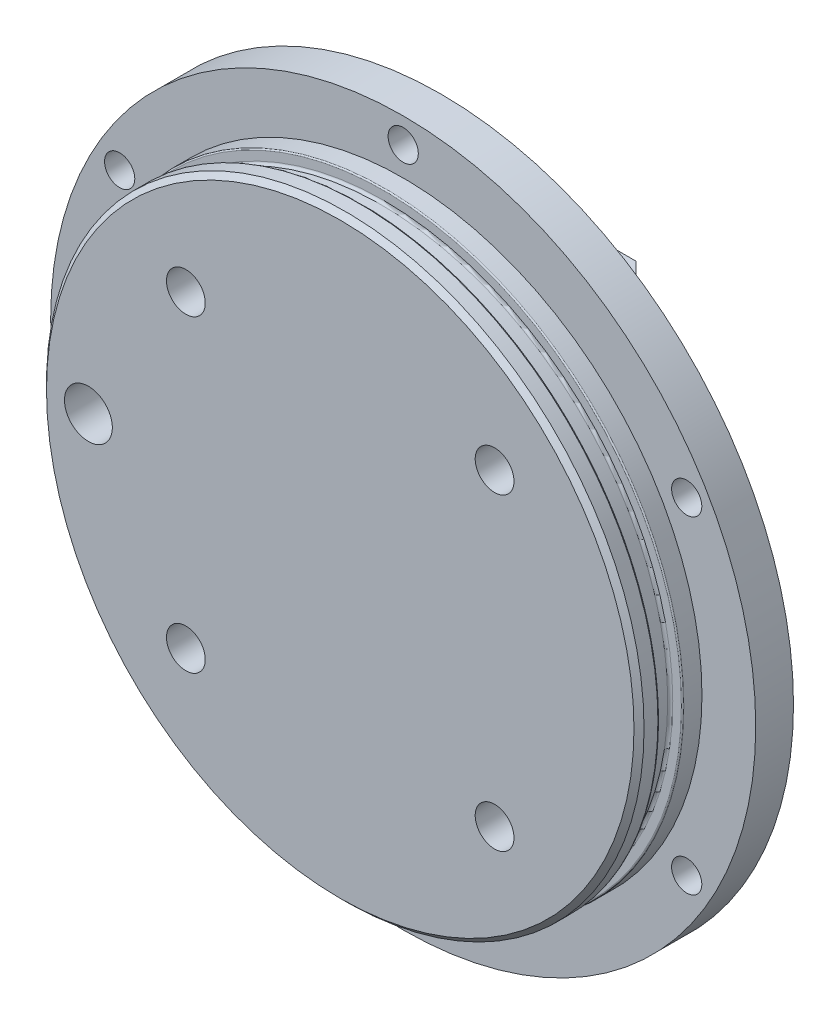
ISO-10303-21;
HEADER;
FILE_DESCRIPTION(('STEP AP214'),'2;1');
FILE_NAME('part.step','',(''),(''),'','','');
FILE_SCHEMA(('AUTOMOTIVE_DESIGN { 1 0 10303 214 1 1 1 1 }'));
ENDSEC;
DATA;
#1=APPLICATION_CONTEXT('core data for automotive mechanical design processes');
#2=APPLICATION_PROTOCOL_DEFINITION('international standard','automotive_design',2000,#1);
#3=PRODUCT_CONTEXT('',#1,'mechanical');
#4=PRODUCT('Part','Part','',(#3));
#5=PRODUCT_RELATED_PRODUCT_CATEGORY('part','',(#4));
#6=PRODUCT_DEFINITION_FORMATION('','',#4);
#7=PRODUCT_DEFINITION_CONTEXT('part definition',#1,'design');
#8=PRODUCT_DEFINITION('design','',#6,#7);
#9=PRODUCT_DEFINITION_SHAPE('','',#8);
#10=(LENGTH_UNIT() NAMED_UNIT(*) SI_UNIT(.MILLI.,.METRE.));
#11=(NAMED_UNIT(*) PLANE_ANGLE_UNIT() SI_UNIT($,.RADIAN.));
#12=(NAMED_UNIT(*) SI_UNIT($,.STERADIAN.) SOLID_ANGLE_UNIT());
#13=UNCERTAINTY_MEASURE_WITH_UNIT(LENGTH_MEASURE(1.E-05),#10,'distance_accuracy_value','');
#14=(GEOMETRIC_REPRESENTATION_CONTEXT(3) GLOBAL_UNCERTAINTY_ASSIGNED_CONTEXT((#13)) GLOBAL_UNIT_ASSIGNED_CONTEXT((#10,
#11,#12)) REPRESENTATION_CONTEXT('',''));
#15=CARTESIAN_POINT('',(0.,0.,0.));
#16=DIRECTION('',(0.,0.,1.));
#17=DIRECTION('',(1.,0.,0.));
#18=AXIS2_PLACEMENT_3D('',#15,#16,#17);
#19=CARTESIAN_POINT('',(0.,0.,10.1600000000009));
#20=DIRECTION('',(0.,0.,1.));
#21=DIRECTION('',(0.999999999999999,0.,0.));
#22=AXIS2_PLACEMENT_3D('',#19,#20,#21);
#23=PLANE('',#22);
#24=CARTESIAN_POINT('',(0.,0.,10.1600000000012));
#25=DIRECTION('',(0.,0.,1.));
#26=DIRECTION('',(0.999999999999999,0.,0.));
#27=AXIS2_PLACEMENT_3D('',#24,#25,#26);
#28=CIRCLE('',#27,29.6291);
#29=CARTESIAN_POINT('',(29.6291,0.,10.1600000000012));
#30=VERTEX_POINT('',#29);
#31=EDGE_CURVE('E40',#30,#30,#28,.T.);
#32=ORIENTED_EDGE('',*,*,#31,.T.);
#33=EDGE_LOOP('',(#32));
#34=FACE_BOUND('',#33,.T.);
#35=CARTESIAN_POINT('',(15.5702000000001,15.5702,10.1600000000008));
#36=DIRECTION('',(0.,0.,1.));
#37=DIRECTION('',(0.999999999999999,0.,0.));
#38=AXIS2_PLACEMENT_3D('',#35,#36,#37);
#39=CIRCLE('',#38,1.9558);
#40=CARTESIAN_POINT('',(17.5260000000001,15.5702,10.1600000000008));
#41=VERTEX_POINT('',#40);
#42=EDGE_CURVE('E207',#41,#41,#39,.T.);
#43=ORIENTED_EDGE('',*,*,#42,.F.);
#44=EDGE_LOOP('',(#43));
#45=FACE_BOUND('',#44,.T.);
#46=CARTESIAN_POINT('',(-15.5701999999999,15.5702,10.1600000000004));
#47=DIRECTION('',(0.,0.,1.));
#48=DIRECTION('',(0.999999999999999,0.,0.));
#49=AXIS2_PLACEMENT_3D('',#46,#47,#48);
#50=CIRCLE('',#49,1.9558);
#51=CARTESIAN_POINT('',(-13.6143999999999,15.5702,10.1600000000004));
#52=VERTEX_POINT('',#51);
#53=EDGE_CURVE('E201',#52,#52,#50,.T.);
#54=ORIENTED_EDGE('',*,*,#53,.F.);
#55=EDGE_LOOP('',(#54));
#56=FACE_BOUND('',#55,.T.);
#57=CARTESIAN_POINT('',(-15.5701999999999,-15.5702000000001,10.1600000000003));
#58=DIRECTION('',(0.,0.,1.));
#59=DIRECTION('',(0.999999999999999,0.,0.));
#60=AXIS2_PLACEMENT_3D('',#57,#58,#59);
#61=CIRCLE('',#60,1.9558);
#62=CARTESIAN_POINT('',(-13.6143999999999,-15.5702000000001,10.1600000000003));
#63=VERTEX_POINT('',#62);
#64=EDGE_CURVE('E195',#63,#63,#61,.T.);
#65=ORIENTED_EDGE('',*,*,#64,.F.);
#66=EDGE_LOOP('',(#65));
#67=FACE_BOUND('',#66,.T.);
#68=CARTESIAN_POINT('',(15.5702000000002,-15.5701999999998,10.1600000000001));
#69=DIRECTION('',(0.,0.,1.));
#70=DIRECTION('',(0.999999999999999,0.,0.));
#71=AXIS2_PLACEMENT_3D('',#68,#69,#70);
#72=CIRCLE('',#71,1.9558);
#73=CARTESIAN_POINT('',(17.5260000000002,-15.5701999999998,10.1600000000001));
#74=VERTEX_POINT('',#73);
#75=EDGE_CURVE('E178',#74,#74,#72,.T.);
#76=ORIENTED_EDGE('',*,*,#75,.F.);
#77=EDGE_LOOP('',(#76));
#78=FACE_BOUND('',#77,.T.);
#79=CARTESIAN_POINT('',(-25.3999999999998,0.,10.1600000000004));
#80=DIRECTION('',(0.,0.,-1.));
#81=DIRECTION('',(-0.999999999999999,0.,0.));
#82=AXIS2_PLACEMENT_3D('',#79,#80,#81);
#83=CIRCLE('',#82,2.41300000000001);
#84=CARTESIAN_POINT('',(-27.8129999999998,0.,10.1600000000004));
#85=VERTEX_POINT('',#84);
#86=EDGE_CURVE('E470',#85,#85,#83,.T.);
#87=ORIENTED_EDGE('',*,*,#86,.T.);
#88=EDGE_LOOP('',(#87));
#89=FACE_BOUND('',#88,.T.);
#90=ADVANCED_FACE('F32',(#34,#45,#56,#67,#78,#89),#23,.T.);
#91=CARTESIAN_POINT('',(0.,0.,-16.5100000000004));
#92=DIRECTION('',(0.,0.,1.));
#93=DIRECTION('',(0.999999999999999,0.,0.));
#94=AXIS2_PLACEMENT_3D('',#91,#92,#93);
#95=CYLINDRICAL_SURFACE('',#94,15.875);
#96=CARTESIAN_POINT('',(0.,0.,0.));
#97=DIRECTION('',(0.,0.,-1.));
#98=DIRECTION('',(-0.999999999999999,0.,0.));
#99=AXIS2_PLACEMENT_3D('',#96,#97,#98);
#100=CIRCLE('',#99,15.875);
#101=CARTESIAN_POINT('',(-15.8749999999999,0.,0.));
#102=VERTEX_POINT('',#101);
#103=EDGE_CURVE('E185',#102,#102,#100,.T.);
#104=ORIENTED_EDGE('',*,*,#103,.T.);
#105=EDGE_LOOP('',(#104));
#106=FACE_BOUND('',#105,.T.);
#107=CARTESIAN_POINT('',(1.11022302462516E-13,0.,-19.6850000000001));
#108=DIRECTION('',(-0.707106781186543,0.,-0.707106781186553));
#109=DIRECTION('',(-0.70710678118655,0.,0.707106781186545));
#110=AXIS2_PLACEMENT_3D('',#107,#108,#109);
#111=ELLIPSE('',#110,22.4506403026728,15.875);
#112=CARTESIAN_POINT('',(-15.1437848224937,4.7625,-4.54121517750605));
#113=VERTEX_POINT('',#112);
#114=CARTESIAN_POINT('',(-6.91975207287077,14.2874999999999,-12.7652479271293));
#115=VERTEX_POINT('',#114);
#116=EDGE_CURVE('E482',#113,#115,#111,.T.);
#117=ORIENTED_EDGE('',*,*,#116,.F.);
#118=DIRECTION('',(0.,0.,-1.));
#119=VECTOR('',#118,1.);
#120=CARTESIAN_POINT('',(-15.143784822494,4.76249999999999,-0.253999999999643));
#121=LINE('',#120,#119);
#122=CARTESIAN_POINT('',(-15.143784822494,4.76249999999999,-0.253999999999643));
#123=VERTEX_POINT('',#122);
#124=EDGE_CURVE('E182',#123,#113,#121,.T.);
#125=ORIENTED_EDGE('',*,*,#124,.F.);
#126=CARTESIAN_POINT('',(0.,0.,-0.253999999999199));
#127=DIRECTION('',(0.,0.,-1.));
#128=DIRECTION('',(-0.999999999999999,0.,0.));
#129=AXIS2_PLACEMENT_3D('',#126,#127,#128);
#130=CIRCLE('',#129,15.875);
#131=CARTESIAN_POINT('',(-15.1437848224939,-4.76250000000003,-0.25399999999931));
#132=VERTEX_POINT('',#131);
#133=EDGE_CURVE('E523',#132,#123,#130,.T.);
#134=ORIENTED_EDGE('',*,*,#133,.F.);
#135=DIRECTION('',(0.,0.,-1.));
#136=VECTOR('',#135,1.);
#137=CARTESIAN_POINT('',(-15.1437848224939,-4.76250000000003,-0.25399999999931));
#138=LINE('',#137,#136);
#139=CARTESIAN_POINT('',(-15.1437848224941,-4.7625,-4.54121517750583));
#140=VERTEX_POINT('',#139);
#141=EDGE_CURVE('E163',#132,#140,#138,.T.);
#142=ORIENTED_EDGE('',*,*,#141,.T.);
#143=CARTESIAN_POINT('',(-6.91975207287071,-14.2875,-12.7652479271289));
#144=VERTEX_POINT('',#143);
#145=EDGE_CURVE('E47',#144,#140,#111,.T.);
#146=ORIENTED_EDGE('',*,*,#145,.F.);
#147=DIRECTION('',(0.,0.,-1.));
#148=VECTOR('',#147,1.);
#149=CARTESIAN_POINT('',(-6.91975207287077,-14.2875,-0.253999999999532));
#150=LINE('',#149,#148);
#151=CARTESIAN_POINT('',(-6.91975207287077,-14.2875,-0.253999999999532));
#152=VERTEX_POINT('',#151);
#153=EDGE_CURVE('E510',#152,#144,#150,.T.);
#154=ORIENTED_EDGE('',*,*,#153,.F.);
#155=CARTESIAN_POINT('',(6.91975207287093,-14.2875,-0.253999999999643));
#156=VERTEX_POINT('',#155);
#157=EDGE_CURVE('E188',#156,#152,#130,.T.);
#158=ORIENTED_EDGE('',*,*,#157,.F.);
#159=DIRECTION('',(0.,0.,-1.));
#160=VECTOR('',#159,1.);
#161=CARTESIAN_POINT('',(6.91975207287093,-14.2875,-0.253999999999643));
#162=LINE('',#161,#160);
#163=CARTESIAN_POINT('',(6.91975207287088,-14.2875,-12.7652479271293));
#164=VERTEX_POINT('',#163);
#165=EDGE_CURVE('E166',#156,#164,#162,.T.);
#166=ORIENTED_EDGE('',*,*,#165,.T.);
#167=CARTESIAN_POINT('',(1.11022302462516E-13,0.,-19.6850000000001));
#168=DIRECTION('',(0.707106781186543,0.,-0.707106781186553));
#169=DIRECTION('',(0.70710678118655,0.,0.707106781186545));
#170=AXIS2_PLACEMENT_3D('',#167,#168,#169);
#171=ELLIPSE('',#170,22.4506403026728,15.875);
#172=CARTESIAN_POINT('',(15.1437848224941,-4.76250000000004,-4.54121517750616));
#173=VERTEX_POINT('',#172);
#174=EDGE_CURVE('E476',#173,#164,#171,.T.);
#175=ORIENTED_EDGE('',*,*,#174,.F.);
#176=DIRECTION('',(0.,0.,-1.));
#177=VECTOR('',#176,1.);
#178=CARTESIAN_POINT('',(15.143784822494,-4.76250000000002,-0.25400000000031));
#179=LINE('',#178,#177);
#180=CARTESIAN_POINT('',(15.143784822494,-4.76250000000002,-0.25400000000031));
#181=VERTEX_POINT('',#180);
#182=EDGE_CURVE('E158',#181,#173,#179,.T.);
#183=ORIENTED_EDGE('',*,*,#182,.F.);
#184=CARTESIAN_POINT('',(15.143784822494,4.7625,-0.253999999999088));
#185=VERTEX_POINT('',#184);
#186=EDGE_CURVE('E284',#185,#181,#130,.T.);
#187=ORIENTED_EDGE('',*,*,#186,.F.);
#188=DIRECTION('',(0.,0.,-1.));
#189=VECTOR('',#188,1.);
#190=CARTESIAN_POINT('',(15.143784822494,4.7625,-0.253999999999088));
#191=LINE('',#190,#189);
#192=CARTESIAN_POINT('',(15.1437848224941,4.76249999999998,-4.54121517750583));
#193=VERTEX_POINT('',#192);
#194=EDGE_CURVE('E174',#185,#193,#191,.T.);
#195=ORIENTED_EDGE('',*,*,#194,.T.);
#196=CARTESIAN_POINT('',(6.91975207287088,14.2875,-12.765247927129));
#197=VERTEX_POINT('',#196);
#198=EDGE_CURVE('E138',#197,#193,#171,.T.);
#199=ORIENTED_EDGE('',*,*,#198,.F.);
#200=DIRECTION('',(0.,0.,-1.));
#201=VECTOR('',#200,1.);
#202=CARTESIAN_POINT('',(6.91975207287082,14.2875,-0.253999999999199));
#203=LINE('',#202,#201);
#204=CARTESIAN_POINT('',(6.91975207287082,14.2875,-0.253999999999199));
#205=VERTEX_POINT('',#204);
#206=EDGE_CURVE('E175',#205,#197,#203,.T.);
#207=ORIENTED_EDGE('',*,*,#206,.F.);
#208=CARTESIAN_POINT('',(-6.91975207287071,14.2875,-0.253999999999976));
#209=VERTEX_POINT('',#208);
#210=EDGE_CURVE('E281',#209,#205,#130,.T.);
#211=ORIENTED_EDGE('',*,*,#210,.F.);
#212=DIRECTION('',(0.,0.,-1.));
#213=VECTOR('',#212,1.);
#214=CARTESIAN_POINT('',(-6.91975207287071,14.2875,-0.253999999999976));
#215=LINE('',#214,#213);
#216=EDGE_CURVE('E179',#209,#115,#215,.T.);
#217=ORIENTED_EDGE('',*,*,#216,.T.);
#218=EDGE_LOOP('',(#117,#125,#134,#142,#146,#154,#158,#166,#175,#183,#187,#195,#199,#207,#211,#217));
#219=FACE_BOUND('',#218,.T.);
#220=ADVANCED_FACE('F311',(#106,#219),#95,.T.);
#221=CARTESIAN_POINT('',(0.,0.,-16.5100000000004));
#222=DIRECTION('',(0.,0.,-1.));
#223=DIRECTION('',(-0.999999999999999,0.,0.));
#224=AXIS2_PLACEMENT_3D('',#221,#222,#223);
#225=PLANE('',#224);
#226=DIRECTION('',(0.,-1.,0.));
#227=VECTOR('',#226,1.);
#228=CARTESIAN_POINT('',(-3.17500000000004,144.355977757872,-16.5099999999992));
#229=LINE('',#228,#227);
#230=CARTESIAN_POINT('',(-3.17499999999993,14.2875,-16.5099999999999));
#231=VERTEX_POINT('',#230);
#232=CARTESIAN_POINT('',(-3.17499999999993,4.76249999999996,-16.5099999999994));
#233=VERTEX_POINT('',#232);
#234=EDGE_CURVE('E475',#231,#233,#229,.T.);
#235=ORIENTED_EDGE('',*,*,#234,.F.);
#236=DIRECTION('',(0.999999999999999,0.,0.));
#237=VECTOR('',#236,1.);
#238=CARTESIAN_POINT('',(6.91975207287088,14.2875,-16.5099999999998));
#239=LINE('',#238,#237);
#240=CARTESIAN_POINT('',(3.17500000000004,14.2875,-16.5099999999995));
#241=VERTEX_POINT('',#240);
#242=EDGE_CURVE('E151',#231,#241,#239,.T.);
#243=ORIENTED_EDGE('',*,*,#242,.T.);
#244=DIRECTION('',(0.,-1.,0.));
#245=VECTOR('',#244,1.);
#246=CARTESIAN_POINT('',(3.17500000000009,144.355977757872,-16.5099999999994));
#247=LINE('',#246,#245);
#248=CARTESIAN_POINT('',(3.17500000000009,4.76249999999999,-16.5099999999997));
#249=VERTEX_POINT('',#248);
#250=EDGE_CURVE('E135',#241,#249,#247,.T.);
#251=ORIENTED_EDGE('',*,*,#250,.T.);
#252=DIRECTION('',(-0.999999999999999,0.,0.));
#253=VECTOR('',#252,1.);
#254=CARTESIAN_POINT('',(15.1437848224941,4.76249999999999,-16.5099999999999));
#255=LINE('',#254,#253);
#256=EDGE_CURVE('E149',#249,#233,#255,.T.);
#257=ORIENTED_EDGE('',*,*,#256,.T.);
#258=EDGE_LOOP('',(#235,#243,#251,#257));
#259=FACE_BOUND('',#258,.T.);
#260=ADVANCED_FACE('F148',(#259),#225,.T.);
#261=CARTESIAN_POINT('',(-3.17499999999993,-4.7625,-16.5099999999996));
#262=VERTEX_POINT('',#261);
#263=CARTESIAN_POINT('',(-3.17499999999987,-14.2875,-16.5100000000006));
#264=VERTEX_POINT('',#263);
#265=EDGE_CURVE('E152',#262,#264,#229,.T.);
#266=ORIENTED_EDGE('',*,*,#265,.F.);
#267=DIRECTION('',(0.999999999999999,0.,0.));
#268=VECTOR('',#267,1.);
#269=CARTESIAN_POINT('',(15.143784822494,-4.76250000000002,-16.5099999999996));
#270=LINE('',#269,#268);
#271=CARTESIAN_POINT('',(3.17499999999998,-4.76249999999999,-16.5100000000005));
#272=VERTEX_POINT('',#271);
#273=EDGE_CURVE('E500',#262,#272,#270,.T.);
#274=ORIENTED_EDGE('',*,*,#273,.T.);
#275=CARTESIAN_POINT('',(3.17500000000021,-14.2875,-16.5099999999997));
#276=VERTEX_POINT('',#275);
#277=EDGE_CURVE('E55',#272,#276,#247,.T.);
#278=ORIENTED_EDGE('',*,*,#277,.T.);
#279=DIRECTION('',(-0.999999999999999,0.,0.));
#280=VECTOR('',#279,1.);
#281=CARTESIAN_POINT('',(-6.9197520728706,-14.2875,-16.5099999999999));
#282=LINE('',#281,#280);
#283=EDGE_CURVE('E497',#276,#264,#282,.T.);
#284=ORIENTED_EDGE('',*,*,#283,.T.);
#285=EDGE_LOOP('',(#266,#274,#278,#284));
#286=FACE_BOUND('',#285,.T.);
#287=ADVANCED_FACE('F419',(#286),#225,.T.);
#288=CARTESIAN_POINT('',(-6.91975207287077,-14.2875,-0.253999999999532));
#289=DIRECTION('',(0.,-1.,0.));
#290=DIRECTION('',(0.,0.,-1.));
#291=AXIS2_PLACEMENT_3D('',#288,#289,#290);
#292=PLANE('',#291);
#293=CARTESIAN_POINT('',(0.,-14.2875,-10.1599999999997));
#294=DIRECTION('',(0.,-1.,0.));
#295=DIRECTION('',(0.,0.,-1.));
#296=AXIS2_PLACEMENT_3D('',#293,#294,#295);
#297=CIRCLE('',#296,3.175);
#298=CARTESIAN_POINT('',(3.175,-14.2875,-10.1599999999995));
#299=VERTEX_POINT('',#298);
#300=EDGE_CURVE('E494',#299,#299,#297,.T.);
#301=ORIENTED_EDGE('',*,*,#300,.F.);
#302=EDGE_LOOP('',(#301));
#303=FACE_BOUND('',#302,.T.);
#304=ORIENTED_EDGE('',*,*,#153,.T.);
#305=DIRECTION('',(0.70710678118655,0.,-0.707106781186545));
#306=VECTOR('',#305,1.);
#307=CARTESIAN_POINT('',(-13.1753760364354,-14.2875,-6.50962396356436));
#308=LINE('',#307,#306);
#309=EDGE_CURVE('E289',#144,#264,#308,.T.);
#310=ORIENTED_EDGE('',*,*,#309,.T.);
#311=ORIENTED_EDGE('',*,*,#283,.F.);
#312=DIRECTION('',(0.70710678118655,0.,0.707106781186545));
#313=VECTOR('',#312,1.);
#314=CARTESIAN_POINT('',(6.2556239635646,-14.2875,-13.4293760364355));
#315=LINE('',#314,#313);
#316=EDGE_CURVE('E479',#276,#164,#315,.T.);
#317=ORIENTED_EDGE('',*,*,#316,.T.);
#318=ORIENTED_EDGE('',*,*,#165,.F.);
#319=DIRECTION('',(-0.999999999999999,0.,0.));
#320=VECTOR('',#319,1.);
#321=CARTESIAN_POINT('',(-6.91975207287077,-14.2875,-0.253999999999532));
#322=LINE('',#321,#320);
#323=EDGE_CURVE('E503',#156,#152,#322,.T.);
#324=ORIENTED_EDGE('',*,*,#323,.T.);
#325=EDGE_LOOP('',(#304,#310,#311,#317,#318,#324));
#326=FACE_BOUND('',#325,.T.);
#327=ADVANCED_FACE('F433',(#303,#326),#292,.T.);
#328=CARTESIAN_POINT('',(15.143784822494,-4.76250000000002,-0.25400000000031));
#329=DIRECTION('',(0.,1.,0.));
#330=DIRECTION('',(-0.999999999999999,0.,0.));
#331=AXIS2_PLACEMENT_3D('',#328,#329,#330);
#332=PLANE('',#331);
#333=CARTESIAN_POINT('',(0.,-4.76250000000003,-10.1599999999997));
#334=DIRECTION('',(0.,1.,0.));
#335=DIRECTION('',(-0.999999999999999,0.,0.));
#336=AXIS2_PLACEMENT_3D('',#333,#334,#335);
#337=CIRCLE('',#336,3.175);
#338=CARTESIAN_POINT('',(3.175,-4.76250000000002,-10.1599999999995));
#339=VERTEX_POINT('',#338);
#340=EDGE_CURVE('E491',#339,#339,#337,.T.);
#341=ORIENTED_EDGE('',*,*,#340,.F.);
#342=EDGE_LOOP('',(#341));
#343=FACE_BOUND('',#342,.T.);
#344=ORIENTED_EDGE('',*,*,#273,.F.);
#345=DIRECTION('',(-0.70710678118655,0.,0.707106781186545));
#346=VECTOR('',#345,1.);
#347=CARTESIAN_POINT('',(-2.14360758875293,-4.76249999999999,-17.5413924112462));
#348=LINE('',#347,#346);
#349=EDGE_CURVE('E485',#262,#140,#348,.T.);
#350=ORIENTED_EDGE('',*,*,#349,.T.);
#351=ORIENTED_EDGE('',*,*,#141,.F.);
#352=DIRECTION('',(0.999999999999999,0.,0.));
#353=VECTOR('',#352,1.);
#354=CARTESIAN_POINT('',(15.143784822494,-4.76250000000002,-0.25400000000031));
#355=LINE('',#354,#353);
#356=EDGE_CURVE('E506',#132,#181,#355,.T.);
#357=ORIENTED_EDGE('',*,*,#356,.T.);
#358=ORIENTED_EDGE('',*,*,#182,.T.);
#359=DIRECTION('',(-0.70710678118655,0.,-0.707106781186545));
#360=VECTOR('',#359,1.);
#361=CARTESIAN_POINT('',(17.2873924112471,-4.76250000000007,-2.39760758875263));
#362=LINE('',#361,#360);
#363=EDGE_CURVE('E142',#173,#272,#362,.T.);
#364=ORIENTED_EDGE('',*,*,#363,.T.);
#365=EDGE_LOOP('',(#344,#350,#351,#357,#358,#364));
#366=FACE_BOUND('',#365,.T.);
#367=ADVANCED_FACE('F428',(#343,#366),#332,.T.);
#368=CARTESIAN_POINT('',(15.143784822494,4.7625,-0.253999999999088));
#369=DIRECTION('',(0.,-1.,0.));
#370=DIRECTION('',(0.,0.,-1.));
#371=AXIS2_PLACEMENT_3D('',#368,#369,#370);
#372=PLANE('',#371);
#373=CARTESIAN_POINT('',(0.,4.76249999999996,-10.1599999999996));
#374=DIRECTION('',(0.,-1.,0.));
#375=DIRECTION('',(0.,0.,-1.));
#376=AXIS2_PLACEMENT_3D('',#373,#374,#375);
#377=CIRCLE('',#376,3.175);
#378=CARTESIAN_POINT('',(3.175,4.76249999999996,-10.1599999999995));
#379=VERTEX_POINT('',#378);
#380=EDGE_CURVE('E288',#379,#379,#377,.T.);
#381=ORIENTED_EDGE('',*,*,#380,.F.);
#382=EDGE_LOOP('',(#381));
#383=FACE_BOUND('',#382,.T.);
#384=ORIENTED_EDGE('',*,*,#124,.T.);
#385=DIRECTION('',(0.70710678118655,0.,-0.707106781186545));
#386=VECTOR('',#385,1.);
#387=CARTESIAN_POINT('',(-2.14360758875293,4.7625,-17.5413924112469));
#388=LINE('',#387,#386);
#389=EDGE_CURVE('E157',#113,#233,#388,.T.);
#390=ORIENTED_EDGE('',*,*,#389,.T.);
#391=ORIENTED_EDGE('',*,*,#256,.F.);
#392=DIRECTION('',(0.70710678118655,0.,0.707106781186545));
#393=VECTOR('',#392,1.);
#394=CARTESIAN_POINT('',(17.287392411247,4.7625,-2.39760758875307));
#395=LINE('',#394,#393);
#396=EDGE_CURVE('E132',#249,#193,#395,.T.);
#397=ORIENTED_EDGE('',*,*,#396,.T.);
#398=ORIENTED_EDGE('',*,*,#194,.F.);
#399=DIRECTION('',(-0.999999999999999,0.,0.));
#400=VECTOR('',#399,1.);
#401=CARTESIAN_POINT('',(15.143784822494,4.7625,-0.253999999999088));
#402=LINE('',#401,#400);
#403=EDGE_CURVE('E160',#185,#123,#402,.T.);
#404=ORIENTED_EDGE('',*,*,#403,.T.);
#405=EDGE_LOOP('',(#384,#390,#391,#397,#398,#404));
#406=FACE_BOUND('',#405,.T.);
#407=ADVANCED_FACE('F156',(#383,#406),#372,.T.);
#408=CARTESIAN_POINT('',(6.91975207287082,14.2875,-0.253999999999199));
#409=DIRECTION('',(0.,1.,0.));
#410=DIRECTION('',(0.,0.,1.));
#411=AXIS2_PLACEMENT_3D('',#408,#409,#410);
#412=PLANE('',#411);
#413=CARTESIAN_POINT('',(1.11022302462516E-13,14.2875,-10.1600000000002));
#414=DIRECTION('',(0.,1.,0.));
#415=DIRECTION('',(0.,0.,1.));
#416=AXIS2_PLACEMENT_3D('',#413,#414,#415);
#417=CIRCLE('',#416,3.175);
#418=CARTESIAN_POINT('',(3.175,14.2875,-10.1599999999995));
#419=VERTEX_POINT('',#418);
#420=EDGE_CURVE('E285',#419,#419,#417,.T.);
#421=ORIENTED_EDGE('',*,*,#420,.F.);
#422=EDGE_LOOP('',(#421));
#423=FACE_BOUND('',#422,.T.);
#424=ORIENTED_EDGE('',*,*,#242,.F.);
#425=DIRECTION('',(-0.70710678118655,0.,0.707106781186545));
#426=VECTOR('',#425,1.);
#427=CARTESIAN_POINT('',(-6.25562396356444,14.2875,-13.4293760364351));
#428=LINE('',#427,#426);
#429=EDGE_CURVE('E291',#231,#115,#428,.T.);
#430=ORIENTED_EDGE('',*,*,#429,.T.);
#431=ORIENTED_EDGE('',*,*,#216,.F.);
#432=DIRECTION('',(0.999999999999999,0.,0.));
#433=VECTOR('',#432,1.);
#434=CARTESIAN_POINT('',(6.91975207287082,14.2875,-0.253999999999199));
#435=LINE('',#434,#433);
#436=EDGE_CURVE('E171',#209,#205,#435,.T.);
#437=ORIENTED_EDGE('',*,*,#436,.T.);
#438=ORIENTED_EDGE('',*,*,#206,.T.);
#439=DIRECTION('',(-0.70710678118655,0.,-0.707106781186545));
#440=VECTOR('',#439,1.);
#441=CARTESIAN_POINT('',(13.1753760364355,14.2875,-6.50962396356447));
#442=LINE('',#441,#440);
#443=EDGE_CURVE('E283',#197,#241,#442,.T.);
#444=ORIENTED_EDGE('',*,*,#443,.T.);
#445=EDGE_LOOP('',(#424,#430,#431,#437,#438,#444));
#446=FACE_BOUND('',#445,.T.);
#447=ADVANCED_FACE('F322',(#423,#446),#412,.T.);
#448=CARTESIAN_POINT('',(0.,0.,0.));
#449=DIRECTION('',(0.,0.,1.));
#450=DIRECTION('',(0.999999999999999,0.,0.));
#451=AXIS2_PLACEMENT_3D('',#448,#449,#450);
#452=PLANE('',#451);
#453=CARTESIAN_POINT('',(-25.3999999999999,0.,6.66133814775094E-13));
#454=DIRECTION('',(0.,0.,-1.));
#455=DIRECTION('',(-0.999999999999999,0.,0.));
#456=AXIS2_PLACEMENT_3D('',#453,#454,#455);
#457=CIRCLE('',#456,6.35000000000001);
#458=CARTESIAN_POINT('',(-31.7499999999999,0.,6.66508341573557E-13));
#459=VERTEX_POINT('',#458);
#460=EDGE_CURVE('E466',#459,#459,#457,.T.);
#461=ORIENTED_EDGE('',*,*,#460,.F.);
#462=EDGE_LOOP('',(#461));
#463=FACE_BOUND('',#462,.T.);
#464=CARTESIAN_POINT('',(0.,0.,0.));
#465=DIRECTION('',(0.,0.,1.));
#466=DIRECTION('',(0.999999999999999,0.,0.));
#467=AXIS2_PLACEMENT_3D('',#464,#465,#466);
#468=CIRCLE('',#467,35.56);
#469=CARTESIAN_POINT('',(35.56,0.,0.));
#470=VERTEX_POINT('',#469);
#471=EDGE_CURVE('E253',#470,#470,#468,.T.);
#472=ORIENTED_EDGE('',*,*,#471,.F.);
#473=EDGE_LOOP('',(#472));
#474=FACE_BOUND('',#473,.T.);
#475=CARTESIAN_POINT('',(0.,33.0199999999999,2.22044604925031E-13));
#476=DIRECTION('',(0.,0.,-1.));
#477=DIRECTION('',(-0.999999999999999,0.,0.));
#478=AXIS2_PLACEMENT_3D('',#475,#476,#477);
#479=CIRCLE('',#478,1.524);
#480=CARTESIAN_POINT('',(-1.524,33.0199999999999,2.22134491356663E-13));
#481=VERTEX_POINT('',#480);
#482=EDGE_CURVE('E233',#481,#481,#479,.T.);
#483=ORIENTED_EDGE('',*,*,#482,.F.);
#484=EDGE_LOOP('',(#483));
#485=FACE_BOUND('',#484,.T.);
#486=CARTESIAN_POINT('',(-28.5961588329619,16.5099999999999,9.99200722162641E-13));
#487=DIRECTION('',(0.,0.,-1.));
#488=DIRECTION('',(-0.499999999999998,-0.86602540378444,0.));
#489=AXIS2_PLACEMENT_3D('',#486,#487,#488);
#490=CIRCLE('',#489,1.524);
#491=CARTESIAN_POINT('',(-29.3581588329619,15.1901772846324,9.99243021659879E-13));
#492=VERTEX_POINT('',#491);
#493=EDGE_CURVE('E229',#492,#492,#490,.T.);
#494=ORIENTED_EDGE('',*,*,#493,.F.);
#495=EDGE_LOOP('',(#494));
#496=FACE_BOUND('',#495,.T.);
#497=CARTESIAN_POINT('',(-28.5961588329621,-16.5100000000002,7.7715611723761E-13));
#498=DIRECTION('',(0.,0.,-1.));
#499=DIRECTION('',(0.500000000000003,-0.866025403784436,0.));
#500=AXIS2_PLACEMENT_3D('',#497,#498,#499);
#501=CIRCLE('',#500,1.524);
#502=CARTESIAN_POINT('',(-27.8341588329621,-17.8298227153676,7.77230141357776E-13));
#503=VERTEX_POINT('',#502);
#504=EDGE_CURVE('E225',#503,#503,#501,.T.);
#505=ORIENTED_EDGE('',*,*,#504,.F.);
#506=EDGE_LOOP('',(#505));
#507=FACE_BOUND('',#506,.T.);
#508=CARTESIAN_POINT('',(2.22044604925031E-13,-33.02,1.11022302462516E-13));
#509=DIRECTION('',(0.,0.,-1.));
#510=DIRECTION('',(0.999999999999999,0.,0.));
#511=AXIS2_PLACEMENT_3D('',#508,#509,#510);
#512=CIRCLE('',#511,1.524);
#513=CARTESIAN_POINT('',(1.52400000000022,-33.02,1.11036842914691E-13));
#514=VERTEX_POINT('',#513);
#515=EDGE_CURVE('E221',#514,#514,#512,.T.);
#516=ORIENTED_EDGE('',*,*,#515,.F.);
#517=EDGE_LOOP('',(#516));
#518=FACE_BOUND('',#517,.T.);
#519=CARTESIAN_POINT('',(28.5961588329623,-16.5099999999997,0.));
#520=DIRECTION('',(0.,0.,-1.));
#521=DIRECTION('',(0.499999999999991,0.866025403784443,0.));
#522=AXIS2_PLACEMENT_3D('',#519,#520,#521);
#523=CIRCLE('',#522,1.524);
#524=CARTESIAN_POINT('',(29.3581588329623,-15.1901772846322,0.));
#525=VERTEX_POINT('',#524);
#526=EDGE_CURVE('E217',#525,#525,#523,.T.);
#527=ORIENTED_EDGE('',*,*,#526,.F.);
#528=EDGE_LOOP('',(#527));
#529=FACE_BOUND('',#528,.T.);
#530=CARTESIAN_POINT('',(28.596158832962,16.5100000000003,-2.22044604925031E-13));
#531=DIRECTION('',(0.,0.,-1.));
#532=DIRECTION('',(-0.50000000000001,0.866025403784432,0.));
#533=AXIS2_PLACEMENT_3D('',#530,#531,#532);
#534=CIRCLE('',#533,1.524);
#535=CARTESIAN_POINT('',(27.834158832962,17.8298227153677,-2.22002305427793E-13));
#536=VERTEX_POINT('',#535);
#537=EDGE_CURVE('E213',#536,#536,#534,.T.);
#538=ORIENTED_EDGE('',*,*,#537,.F.);
#539=EDGE_LOOP('',(#538));
#540=FACE_BOUND('',#539,.T.);
#541=ORIENTED_EDGE('',*,*,#103,.F.);
#542=EDGE_LOOP('',(#541));
#543=FACE_BOUND('',#542,.T.);
#544=ADVANCED_FACE('F318',(#463,#474,#485,#496,#507,#518,#529,#540,#543),#452,.F.);
#545=CARTESIAN_POINT('',(0.,0.,3.80999999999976));
#546=DIRECTION('',(0.,0.,1.));
#547=DIRECTION('',(0.999999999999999,0.,0.));
#548=AXIS2_PLACEMENT_3D('',#545,#546,#547);
#549=CYLINDRICAL_SURFACE('',#548,30.1371);
#550=CARTESIAN_POINT('',(0.,0.,5.63880000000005));
#551=DIRECTION('',(0.,0.,1.));
#552=DIRECTION('',(0.999999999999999,0.,0.));
#553=AXIS2_PLACEMENT_3D('',#550,#551,#552);
#554=CIRCLE('',#553,30.1371);
#555=CARTESIAN_POINT('',(30.1371,0.,5.63880000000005));
#556=VERTEX_POINT('',#555);
#557=EDGE_CURVE('E256',#556,#556,#554,.F.);
#558=ORIENTED_EDGE('',*,*,#557,.T.);
#559=EDGE_LOOP('',(#558));
#560=FACE_BOUND('',#559,.T.);
#561=CARTESIAN_POINT('',(0.,0.,3.80999999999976));
#562=DIRECTION('',(0.,0.,1.));
#563=DIRECTION('',(0.999999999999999,0.,0.));
#564=AXIS2_PLACEMENT_3D('',#561,#562,#563);
#565=CIRCLE('',#564,30.1371);
#566=CARTESIAN_POINT('',(30.1371,0.,3.80999999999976));
#567=VERTEX_POINT('',#566);
#568=EDGE_CURVE('E249',#567,#567,#565,.T.);
#569=ORIENTED_EDGE('',*,*,#568,.T.);
#570=EDGE_LOOP('',(#569));
#571=FACE_BOUND('',#570,.T.);
#572=ADVANCED_FACE('F321',(#560,#571),#549,.T.);
#573=CARTESIAN_POINT('',(0.,0.,10.1600000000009));
#574=DIRECTION('',(0.,0.,-1.));
#575=DIRECTION('',(-0.999999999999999,0.,0.));
#576=AXIS2_PLACEMENT_3D('',#573,#574,#575);
#577=CYLINDRICAL_SURFACE('',#576,35.56);
#578=ORIENTED_EDGE('',*,*,#471,.T.);
#579=EDGE_LOOP('',(#578));
#580=FACE_BOUND('',#579,.T.);
#581=CARTESIAN_POINT('',(0.,0.,3.80999999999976));
#582=DIRECTION('',(0.,0.,1.));
#583=DIRECTION('',(0.999999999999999,0.,0.));
#584=AXIS2_PLACEMENT_3D('',#581,#582,#583);
#585=CIRCLE('',#584,35.56);
#586=CARTESIAN_POINT('',(35.56,0.,3.80999999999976));
#587=VERTEX_POINT('',#586);
#588=EDGE_CURVE('E252',#587,#587,#585,.T.);
#589=ORIENTED_EDGE('',*,*,#588,.F.);
#590=EDGE_LOOP('',(#589));
#591=FACE_BOUND('',#590,.T.);
#592=ADVANCED_FACE('F34',(#580,#591),#577,.T.);
#593=CARTESIAN_POINT('',(0.,0.,3.80999999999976));
#594=DIRECTION('',(0.,0.,1.));
#595=DIRECTION('',(0.999999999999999,0.,0.));
#596=AXIS2_PLACEMENT_3D('',#593,#594,#595);
#597=PLANE('',#596);
#598=CARTESIAN_POINT('',(28.5961588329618,16.5100000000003,3.81000000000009));
#599=DIRECTION('',(0.,0.,1.));
#600=DIRECTION('',(0.999999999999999,0.,0.));
#601=AXIS2_PLACEMENT_3D('',#598,#599,#600);
#602=CIRCLE('',#601,1.524);
#603=CARTESIAN_POINT('',(30.1201588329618,16.5100000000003,3.81000000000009));
#604=VERTEX_POINT('',#603);
#605=EDGE_CURVE('E216',#604,#604,#602,.T.);
#606=ORIENTED_EDGE('',*,*,#605,.F.);
#607=EDGE_LOOP('',(#606));
#608=FACE_BOUND('',#607,.T.);
#609=CARTESIAN_POINT('',(28.5961588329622,-16.5099999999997,3.8099999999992));
#610=DIRECTION('',(0.,0.,1.));
#611=DIRECTION('',(0.999999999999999,0.,0.));
#612=AXIS2_PLACEMENT_3D('',#609,#610,#611);
#613=CIRCLE('',#612,1.524);
#614=CARTESIAN_POINT('',(30.1201588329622,-16.5099999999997,3.8099999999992));
#615=VERTEX_POINT('',#614);
#616=EDGE_CURVE('E220',#615,#615,#613,.T.);
#617=ORIENTED_EDGE('',*,*,#616,.F.);
#618=EDGE_LOOP('',(#617));
#619=FACE_BOUND('',#618,.T.);
#620=CARTESIAN_POINT('',(1.66533453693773E-13,-33.02,3.80999999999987));
#621=DIRECTION('',(0.,0.,1.));
#622=DIRECTION('',(0.999999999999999,0.,0.));
#623=AXIS2_PLACEMENT_3D('',#620,#621,#622);
#624=CIRCLE('',#623,1.524);
#625=CARTESIAN_POINT('',(1.52400000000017,-33.02,3.80999999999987));
#626=VERTEX_POINT('',#625);
#627=EDGE_CURVE('E224',#626,#626,#624,.T.);
#628=ORIENTED_EDGE('',*,*,#627,.F.);
#629=EDGE_LOOP('',(#628));
#630=FACE_BOUND('',#629,.T.);
#631=CARTESIAN_POINT('',(-28.5961588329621,-16.5100000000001,3.81000000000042));
#632=DIRECTION('',(0.,0.,1.));
#633=DIRECTION('',(0.999999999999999,0.,0.));
#634=AXIS2_PLACEMENT_3D('',#631,#632,#633);
#635=CIRCLE('',#634,1.524);
#636=CARTESIAN_POINT('',(-27.0721588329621,-16.5100000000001,3.81000000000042));
#637=VERTEX_POINT('',#636);
#638=EDGE_CURVE('E228',#637,#637,#635,.T.);
#639=ORIENTED_EDGE('',*,*,#638,.F.);
#640=EDGE_LOOP('',(#639));
#641=FACE_BOUND('',#640,.T.);
#642=CARTESIAN_POINT('',(-28.5961588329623,16.5099999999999,3.81000000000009));
#643=DIRECTION('',(0.,0.,1.));
#644=DIRECTION('',(0.999999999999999,0.,0.));
#645=AXIS2_PLACEMENT_3D('',#642,#643,#644);
#646=CIRCLE('',#645,1.524);
#647=CARTESIAN_POINT('',(-27.0721588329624,16.5099999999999,3.81000000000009));
#648=VERTEX_POINT('',#647);
#649=EDGE_CURVE('E232',#648,#648,#646,.T.);
#650=ORIENTED_EDGE('',*,*,#649,.F.);
#651=EDGE_LOOP('',(#650));
#652=FACE_BOUND('',#651,.T.);
#653=CARTESIAN_POINT('',(0.,33.02,3.81000000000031));
#654=DIRECTION('',(0.,0.,1.));
#655=DIRECTION('',(0.999999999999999,0.,0.));
#656=AXIS2_PLACEMENT_3D('',#653,#654,#655);
#657=CIRCLE('',#656,1.524);
#658=CARTESIAN_POINT('',(1.52400000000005,33.02,3.81000000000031));
#659=VERTEX_POINT('',#658);
#660=EDGE_CURVE('E236',#659,#659,#657,.T.);
#661=ORIENTED_EDGE('',*,*,#660,.F.);
#662=EDGE_LOOP('',(#661));
#663=FACE_BOUND('',#662,.T.);
#664=ORIENTED_EDGE('',*,*,#568,.F.);
#665=EDGE_LOOP('',(#664));
#666=FACE_BOUND('',#665,.T.);
#667=ORIENTED_EDGE('',*,*,#588,.T.);
#668=EDGE_LOOP('',(#667));
#669=FACE_BOUND('',#668,.T.);
#670=ADVANCED_FACE('F324',(#608,#619,#630,#641,#652,#663,#666,#669),#597,.T.);
#671=CARTESIAN_POINT('',(1.11022302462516E-13,30.1625,8.12799999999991));
#672=DIRECTION('',(0.,0.,-1.));
#673=DIRECTION('',(-0.999999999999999,0.,0.));
#674=AXIS2_PLACEMENT_3D('',#671,#672,#673);
#675=PLANE('',#674);
#676=CARTESIAN_POINT('',(1.11022302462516E-13,0.,8.12800000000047));
#677=DIRECTION('',(0.,0.,-1.));
#678=DIRECTION('',(-0.999999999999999,0.,0.));
#679=AXIS2_PLACEMENT_3D('',#676,#677,#678);
#680=CIRCLE('',#679,30.0101);
#681=CARTESIAN_POINT('',(-30.0100999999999,0.,8.12800000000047));
#682=VERTEX_POINT('',#681);
#683=EDGE_CURVE('E189',#682,#682,#680,.T.);
#684=ORIENTED_EDGE('',*,*,#683,.T.);
#685=EDGE_LOOP('',(#684));
#686=FACE_BOUND('',#685,.T.);
#687=CARTESIAN_POINT('',(1.11022302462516E-13,0.,8.12800000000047));
#688=DIRECTION('',(0.,0.,1.));
#689=DIRECTION('',(0.999999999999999,0.,0.));
#690=AXIS2_PLACEMENT_3D('',#687,#688,#689);
#691=CIRCLE('',#690,29.1465);
#692=CARTESIAN_POINT('',(29.1465000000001,0.,8.12800000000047));
#693=VERTEX_POINT('',#692);
#694=EDGE_CURVE('E237',#693,#693,#691,.T.);
#695=ORIENTED_EDGE('',*,*,#694,.T.);
#696=EDGE_LOOP('',(#695));
#697=FACE_BOUND('',#696,.T.);
#698=ADVANCED_FACE('F327',(#686,#697),#675,.T.);
#699=CARTESIAN_POINT('',(0.,29.1464999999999,5.76579999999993));
#700=DIRECTION('',(0.,0.,1.));
#701=DIRECTION('',(0.999999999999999,0.,0.));
#702=AXIS2_PLACEMENT_3D('',#699,#700,#701);
#703=PLANE('',#702);
#704=CARTESIAN_POINT('',(1.11022302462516E-13,0.,5.76579999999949));
#705=DIRECTION('',(0.,0.,1.));
#706=DIRECTION('',(0.999999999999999,0.,0.));
#707=AXIS2_PLACEMENT_3D('',#704,#705,#706);
#708=CIRCLE('',#707,30.0101);
#709=CARTESIAN_POINT('',(30.0101000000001,0.,5.76579999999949));
#710=VERTEX_POINT('',#709);
#711=EDGE_CURVE('E261',#710,#710,#708,.T.);
#712=ORIENTED_EDGE('',*,*,#711,.T.);
#713=EDGE_LOOP('',(#712));
#714=FACE_BOUND('',#713,.T.);
#715=CARTESIAN_POINT('',(1.11022302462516E-13,0.,5.76579999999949));
#716=DIRECTION('',(0.,0.,1.));
#717=DIRECTION('',(0.999999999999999,0.,0.));
#718=AXIS2_PLACEMENT_3D('',#715,#716,#717);
#719=CIRCLE('',#718,29.1465);
#720=CARTESIAN_POINT('',(29.1465000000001,0.,5.76579999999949));
#721=VERTEX_POINT('',#720);
#722=EDGE_CURVE('E246',#721,#721,#719,.T.);
#723=ORIENTED_EDGE('',*,*,#722,.F.);
#724=EDGE_LOOP('',(#723));
#725=FACE_BOUND('',#724,.T.);
#726=ADVANCED_FACE('F337',(#714,#725),#703,.T.);
#727=CARTESIAN_POINT('',(0.,0.,6.0198000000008));
#728=DIRECTION('',(0.,0.,1.));
#729=DIRECTION('',(0.999999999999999,0.,0.));
#730=AXIS2_PLACEMENT_3D('',#727,#728,#729);
#731=TOROIDAL_SURFACE('',#730,29.1465,0.254);
#732=CARTESIAN_POINT('',(0.,0.,6.0198000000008));
#733=DIRECTION('',(0.,0.,1.));
#734=DIRECTION('',(0.999999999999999,0.,0.));
#735=AXIS2_PLACEMENT_3D('',#732,#733,#734);
#736=CIRCLE('',#735,28.8925);
#737=CARTESIAN_POINT('',(28.8925,0.,6.01980000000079));
#738=VERTEX_POINT('',#737);
#739=EDGE_CURVE('E243',#738,#738,#736,.T.);
#740=ORIENTED_EDGE('',*,*,#739,.F.);
#741=EDGE_LOOP('',(#740));
#742=FACE_BOUND('',#741,.T.);
#743=ORIENTED_EDGE('',*,*,#722,.T.);
#744=EDGE_LOOP('',(#743));
#745=FACE_BOUND('',#744,.T.);
#746=ADVANCED_FACE('F341',(#742,#745),#731,.F.);
#747=CARTESIAN_POINT('',(0.,0.,25.409130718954));
#748=DIRECTION('',(0.,0.,1.));
#749=DIRECTION('',(0.999999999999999,0.,0.));
#750=AXIS2_PLACEMENT_3D('',#747,#748,#749);
#751=CYLINDRICAL_SURFACE('',#750,28.8925);
#752=CARTESIAN_POINT('',(1.11022302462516E-13,0.,7.87400000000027));
#753=DIRECTION('',(0.,0.,1.));
#754=DIRECTION('',(0.999999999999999,0.,0.));
#755=AXIS2_PLACEMENT_3D('',#752,#753,#754);
#756=CIRCLE('',#755,28.8925);
#757=CARTESIAN_POINT('',(28.8925000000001,0.,7.87400000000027));
#758=VERTEX_POINT('',#757);
#759=EDGE_CURVE('E240',#758,#758,#756,.T.);
#760=ORIENTED_EDGE('',*,*,#759,.F.);
#761=EDGE_LOOP('',(#760));
#762=FACE_BOUND('',#761,.T.);
#763=ORIENTED_EDGE('',*,*,#739,.T.);
#764=EDGE_LOOP('',(#763));
#765=FACE_BOUND('',#764,.T.);
#766=ADVANCED_FACE('F345',(#762,#765),#751,.T.);
#767=CARTESIAN_POINT('',(1.11022302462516E-13,0.,7.87400000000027));
#768=DIRECTION('',(0.,0.,1.));
#769=DIRECTION('',(0.999999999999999,0.,0.));
#770=AXIS2_PLACEMENT_3D('',#767,#768,#769);
#771=TOROIDAL_SURFACE('',#770,29.1465,0.254000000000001);
#772=ORIENTED_EDGE('',*,*,#694,.F.);
#773=EDGE_LOOP('',(#772));
#774=FACE_BOUND('',#773,.T.);
#775=ORIENTED_EDGE('',*,*,#759,.T.);
#776=EDGE_LOOP('',(#775));
#777=FACE_BOUND('',#776,.T.);
#778=ADVANCED_FACE('F333',(#774,#777),#771,.F.);
#779=CARTESIAN_POINT('',(0.,0.,9.65200000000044));
#780=DIRECTION('',(0.,0.,1.));
#781=DIRECTION('',(0.999999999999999,0.,0.));
#782=AXIS2_PLACEMENT_3D('',#779,#780,#781);
#783=CIRCLE('',#782,30.1371);
#784=CARTESIAN_POINT('',(30.1370999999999,0.,9.65200000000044));
#785=VERTEX_POINT('',#784);
#786=EDGE_CURVE('E11',#785,#785,#783,.F.);
#787=ORIENTED_EDGE('',*,*,#786,.T.);
#788=EDGE_LOOP('',(#787));
#789=FACE_BOUND('',#788,.T.);
#790=CARTESIAN_POINT('',(0.,0.,8.25500000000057));
#791=DIRECTION('',(0.,0.,-1.));
#792=DIRECTION('',(-0.999999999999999,0.,0.));
#793=AXIS2_PLACEMENT_3D('',#790,#791,#792);
#794=CIRCLE('',#793,30.1371);
#795=CARTESIAN_POINT('',(-30.1371,0.,8.25500000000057));
#796=VERTEX_POINT('',#795);
#797=EDGE_CURVE('E264',#796,#796,#794,.F.);
#798=ORIENTED_EDGE('',*,*,#797,.T.);
#799=EDGE_LOOP('',(#798));
#800=FACE_BOUND('',#799,.T.);
#801=ADVANCED_FACE('F329',(#789,#800),#549,.T.);
#802=CARTESIAN_POINT('',(0.,0.,5.63880000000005));
#803=DIRECTION('',(0.,0.,1.));
#804=DIRECTION('',(0.999999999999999,0.,0.));
#805=AXIS2_PLACEMENT_3D('',#802,#803,#804);
#806=TOROIDAL_SURFACE('',#805,30.0101,0.127);
#807=ORIENTED_EDGE('',*,*,#711,.F.);
#808=EDGE_LOOP('',(#807));
#809=FACE_BOUND('',#808,.T.);
#810=ORIENTED_EDGE('',*,*,#557,.F.);
#811=EDGE_LOOP('',(#810));
#812=FACE_BOUND('',#811,.T.);
#813=ADVANCED_FACE('F332',(#809,#812),#806,.T.);
#814=CARTESIAN_POINT('',(0.,0.,8.25500000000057));
#815=DIRECTION('',(0.,0.,-1.));
#816=DIRECTION('',(-0.999999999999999,0.,0.));
#817=AXIS2_PLACEMENT_3D('',#814,#815,#816);
#818=TOROIDAL_SURFACE('',#817,30.0101,0.127);
#819=ORIENTED_EDGE('',*,*,#683,.F.);
#820=EDGE_LOOP('',(#819));
#821=FACE_BOUND('',#820,.T.);
#822=ORIENTED_EDGE('',*,*,#797,.F.);
#823=EDGE_LOOP('',(#822));
#824=FACE_BOUND('',#823,.T.);
#825=ADVANCED_FACE('F355',(#821,#824),#818,.T.);
#826=CARTESIAN_POINT('',(0.,33.02,10.1600000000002));
#827=DIRECTION('',(0.,0.,-1.));
#828=DIRECTION('',(-0.999999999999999,0.,0.));
#829=AXIS2_PLACEMENT_3D('',#826,#827,#828);
#830=CYLINDRICAL_SURFACE('',#829,1.524);
#831=ORIENTED_EDGE('',*,*,#660,.T.);
#832=EDGE_LOOP('',(#831));
#833=FACE_BOUND('',#832,.T.);
#834=ORIENTED_EDGE('',*,*,#482,.T.);
#835=EDGE_LOOP('',(#834));
#836=FACE_BOUND('',#835,.T.);
#837=ADVANCED_FACE('F359',(#833,#836),#830,.F.);
#838=CARTESIAN_POINT('',(-28.5961588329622,16.5099999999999,10.1600000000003));
#839=DIRECTION('',(0.,0.,-1.));
#840=DIRECTION('',(-0.999999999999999,0.,0.));
#841=AXIS2_PLACEMENT_3D('',#838,#839,#840);
#842=CYLINDRICAL_SURFACE('',#841,1.524);
#843=ORIENTED_EDGE('',*,*,#649,.T.);
#844=EDGE_LOOP('',(#843));
#845=FACE_BOUND('',#844,.T.);
#846=ORIENTED_EDGE('',*,*,#493,.T.);
#847=EDGE_LOOP('',(#846));
#848=FACE_BOUND('',#847,.T.);
#849=ADVANCED_FACE('F363',(#845,#848),#842,.F.);
#850=CARTESIAN_POINT('',(-28.596158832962,-16.5100000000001,10.1600000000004));
#851=DIRECTION('',(0.,0.,-1.));
#852=DIRECTION('',(-0.999999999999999,0.,0.));
#853=AXIS2_PLACEMENT_3D('',#850,#851,#852);
#854=CYLINDRICAL_SURFACE('',#853,1.524);
#855=ORIENTED_EDGE('',*,*,#638,.T.);
#856=EDGE_LOOP('',(#855));
#857=FACE_BOUND('',#856,.T.);
#858=ORIENTED_EDGE('',*,*,#504,.T.);
#859=EDGE_LOOP('',(#858));
#860=FACE_BOUND('',#859,.T.);
#861=ADVANCED_FACE('F367',(#857,#860),#854,.F.);
#862=CARTESIAN_POINT('',(2.22044604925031E-13,-33.02,10.1600000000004));
#863=DIRECTION('',(0.,0.,-1.));
#864=DIRECTION('',(-0.999999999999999,0.,0.));
#865=AXIS2_PLACEMENT_3D('',#862,#863,#864);
#866=CYLINDRICAL_SURFACE('',#865,1.524);
#867=ORIENTED_EDGE('',*,*,#627,.T.);
#868=EDGE_LOOP('',(#867));
#869=FACE_BOUND('',#868,.T.);
#870=ORIENTED_EDGE('',*,*,#515,.T.);
#871=EDGE_LOOP('',(#870));
#872=FACE_BOUND('',#871,.T.);
#873=ADVANCED_FACE('F371',(#869,#872),#866,.F.);
#874=CARTESIAN_POINT('',(28.5961588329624,-16.5099999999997,10.1599999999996));
#875=DIRECTION('',(0.,0.,-1.));
#876=DIRECTION('',(-0.999999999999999,0.,0.));
#877=AXIS2_PLACEMENT_3D('',#874,#875,#876);
#878=CYLINDRICAL_SURFACE('',#877,1.524);
#879=ORIENTED_EDGE('',*,*,#616,.T.);
#880=EDGE_LOOP('',(#879));
#881=FACE_BOUND('',#880,.T.);
#882=ORIENTED_EDGE('',*,*,#526,.T.);
#883=EDGE_LOOP('',(#882));
#884=FACE_BOUND('',#883,.T.);
#885=ADVANCED_FACE('F375',(#881,#884),#878,.F.);
#886=CARTESIAN_POINT('',(28.596158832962,16.5100000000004,10.1600000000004));
#887=DIRECTION('',(0.,0.,-1.));
#888=DIRECTION('',(-0.999999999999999,0.,0.));
#889=AXIS2_PLACEMENT_3D('',#886,#887,#888);
#890=CYLINDRICAL_SURFACE('',#889,1.524);
#891=ORIENTED_EDGE('',*,*,#605,.T.);
#892=EDGE_LOOP('',(#891));
#893=FACE_BOUND('',#892,.T.);
#894=ORIENTED_EDGE('',*,*,#537,.T.);
#895=EDGE_LOOP('',(#894));
#896=FACE_BOUND('',#895,.T.);
#897=ADVANCED_FACE('F379',(#893,#896),#890,.F.);
#898=CARTESIAN_POINT('',(15.5702,15.5702,3.81000000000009));
#899=DIRECTION('',(0.,0.,1.));
#900=DIRECTION('',(0.999999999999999,0.,0.));
#901=AXIS2_PLACEMENT_3D('',#898,#899,#900);
#902=CONICAL_SURFACE('',#901,1.9558,1.02974425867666);
#903=CARTESIAN_POINT('',(15.5702000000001,15.5702,2.63483680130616));
#904=VERTEX_POINT('',#903);
#905=VERTEX_LOOP('',#904);
#906=FACE_BOUND('',#905,.T.);
#907=CARTESIAN_POINT('',(15.5702,15.5702,3.81000000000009));
#908=DIRECTION('',(0.,0.,1.));
#909=DIRECTION('',(0.999999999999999,0.,0.));
#910=AXIS2_PLACEMENT_3D('',#907,#908,#909);
#911=CIRCLE('',#910,1.9558);
#912=CARTESIAN_POINT('',(17.526,15.5702,3.81000000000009));
#913=VERTEX_POINT('',#912);
#914=EDGE_CURVE('E210',#913,#913,#911,.T.);
#915=ORIENTED_EDGE('',*,*,#914,.T.);
#916=EDGE_LOOP('',(#915));
#917=FACE_BOUND('',#916,.T.);
#918=ADVANCED_FACE('F383',(#906,#917),#902,.F.);
#919=CARTESIAN_POINT('',(15.5702000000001,15.5702,10.1600000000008));
#920=DIRECTION('',(0.,0.,1.));
#921=DIRECTION('',(0.999999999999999,0.,0.));
#922=AXIS2_PLACEMENT_3D('',#919,#920,#921);
#923=CYLINDRICAL_SURFACE('',#922,1.9558);
#924=ORIENTED_EDGE('',*,*,#914,.F.);
#925=EDGE_LOOP('',(#924));
#926=FACE_BOUND('',#925,.T.);
#927=ORIENTED_EDGE('',*,*,#42,.T.);
#928=EDGE_LOOP('',(#927));
#929=FACE_BOUND('',#928,.T.);
#930=ADVANCED_FACE('F387',(#926,#929),#923,.F.);
#931=CARTESIAN_POINT('',(-15.5702,15.5702,3.81000000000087));
#932=DIRECTION('',(0.,0.,1.));
#933=DIRECTION('',(0.999999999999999,0.,0.));
#934=AXIS2_PLACEMENT_3D('',#931,#932,#933);
#935=CONICAL_SURFACE('',#934,1.9558,1.02974425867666);
#936=CARTESIAN_POINT('',(-15.5702,15.5701999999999,2.63483680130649));
#937=VERTEX_POINT('',#936);
#938=VERTEX_LOOP('',#937);
#939=FACE_BOUND('',#938,.T.);
#940=CARTESIAN_POINT('',(-15.5702,15.5702,3.81000000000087));
#941=DIRECTION('',(0.,0.,1.));
#942=DIRECTION('',(0.999999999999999,0.,0.));
#943=AXIS2_PLACEMENT_3D('',#940,#941,#942);
#944=CIRCLE('',#943,1.9558);
#945=CARTESIAN_POINT('',(-13.6144,15.5702,3.81000000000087));
#946=VERTEX_POINT('',#945);
#947=EDGE_CURVE('E204',#946,#946,#944,.T.);
#948=ORIENTED_EDGE('',*,*,#947,.T.);
#949=EDGE_LOOP('',(#948));
#950=FACE_BOUND('',#949,.T.);
#951=ADVANCED_FACE('F391',(#939,#950),#935,.F.);
#952=CARTESIAN_POINT('',(-15.5701999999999,15.5702,10.1600000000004));
#953=DIRECTION('',(0.,0.,1.));
#954=DIRECTION('',(0.999999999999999,0.,0.));
#955=AXIS2_PLACEMENT_3D('',#952,#953,#954);
#956=CYLINDRICAL_SURFACE('',#955,1.9558);
#957=ORIENTED_EDGE('',*,*,#947,.F.);
#958=EDGE_LOOP('',(#957));
#959=FACE_BOUND('',#958,.T.);
#960=ORIENTED_EDGE('',*,*,#53,.T.);
#961=EDGE_LOOP('',(#960));
#962=FACE_BOUND('',#961,.T.);
#963=ADVANCED_FACE('F395',(#959,#962),#956,.F.);
#964=CARTESIAN_POINT('',(-15.5701999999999,-15.5702000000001,3.81000000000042));
#965=DIRECTION('',(0.,0.,1.));
#966=DIRECTION('',(0.999999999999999,0.,0.));
#967=AXIS2_PLACEMENT_3D('',#964,#965,#966);
#968=CONICAL_SURFACE('',#967,1.9558,1.02974425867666);
#969=CARTESIAN_POINT('',(-15.5701999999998,-15.5702000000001,2.63483680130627));
#970=VERTEX_POINT('',#969);
#971=VERTEX_LOOP('',#970);
#972=FACE_BOUND('',#971,.T.);
#973=CARTESIAN_POINT('',(-15.5701999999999,-15.5702000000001,3.81000000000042));
#974=DIRECTION('',(0.,0.,1.));
#975=DIRECTION('',(0.999999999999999,0.,0.));
#976=AXIS2_PLACEMENT_3D('',#973,#974,#975);
#977=CIRCLE('',#976,1.9558);
#978=CARTESIAN_POINT('',(-13.6143999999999,-15.5702000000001,3.81000000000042));
#979=VERTEX_POINT('',#978);
#980=EDGE_CURVE('E198',#979,#979,#977,.T.);
#981=ORIENTED_EDGE('',*,*,#980,.T.);
#982=EDGE_LOOP('',(#981));
#983=FACE_BOUND('',#982,.T.);
#984=ADVANCED_FACE('F399',(#972,#983),#968,.F.);
#985=CARTESIAN_POINT('',(-15.5701999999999,-15.5702000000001,10.1600000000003));
#986=DIRECTION('',(0.,0.,1.));
#987=DIRECTION('',(0.999999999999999,0.,0.));
#988=AXIS2_PLACEMENT_3D('',#985,#986,#987);
#989=CYLINDRICAL_SURFACE('',#988,1.9558);
#990=ORIENTED_EDGE('',*,*,#980,.F.);
#991=EDGE_LOOP('',(#990));
#992=FACE_BOUND('',#991,.T.);
#993=ORIENTED_EDGE('',*,*,#64,.T.);
#994=EDGE_LOOP('',(#993));
#995=FACE_BOUND('',#994,.T.);
#996=ADVANCED_FACE('F403',(#992,#995),#989,.F.);
#997=CARTESIAN_POINT('',(15.5702000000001,-15.5701999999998,3.80999999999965));
#998=DIRECTION('',(0.,0.,1.));
#999=DIRECTION('',(0.999999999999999,0.,0.));
#1000=AXIS2_PLACEMENT_3D('',#997,#998,#999);
#1001=CONICAL_SURFACE('',#1000,1.9558,1.02974425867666);
#1002=CARTESIAN_POINT('',(15.5702000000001,-15.5701999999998,2.63483680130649));
#1003=VERTEX_POINT('',#1002);
#1004=VERTEX_LOOP('',#1003);
#1005=FACE_BOUND('',#1004,.T.);
#1006=CARTESIAN_POINT('',(15.5702000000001,-15.5701999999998,3.80999999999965));
#1007=DIRECTION('',(0.,0.,1.));
#1008=DIRECTION('',(0.999999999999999,0.,0.));
#1009=AXIS2_PLACEMENT_3D('',#1006,#1007,#1008);
#1010=CIRCLE('',#1009,1.9558);
#1011=CARTESIAN_POINT('',(17.5260000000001,-15.5701999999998,3.80999999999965));
#1012=VERTEX_POINT('',#1011);
#1013=EDGE_CURVE('E192',#1012,#1012,#1010,.T.);
#1014=ORIENTED_EDGE('',*,*,#1013,.T.);
#1015=EDGE_LOOP('',(#1014));
#1016=FACE_BOUND('',#1015,.T.);
#1017=ADVANCED_FACE('F407',(#1005,#1016),#1001,.F.);
#1018=CARTESIAN_POINT('',(15.5702000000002,-15.5701999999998,10.1600000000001));
#1019=DIRECTION('',(0.,0.,1.));
#1020=DIRECTION('',(0.999999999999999,0.,0.));
#1021=AXIS2_PLACEMENT_3D('',#1018,#1019,#1020);
#1022=CYLINDRICAL_SURFACE('',#1021,1.9558);
#1023=ORIENTED_EDGE('',*,*,#1013,.F.);
#1024=EDGE_LOOP('',(#1023));
#1025=FACE_BOUND('',#1024,.T.);
#1026=ORIENTED_EDGE('',*,*,#75,.T.);
#1027=EDGE_LOOP('',(#1026));
#1028=FACE_BOUND('',#1027,.T.);
#1029=ADVANCED_FACE('F411',(#1025,#1028),#1022,.F.);
#1030=CARTESIAN_POINT('',(0.,0.,-0.253999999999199));
#1031=DIRECTION('',(0.,0.,-1.));
#1032=DIRECTION('',(-0.999999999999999,0.,0.));
#1033=AXIS2_PLACEMENT_3D('',#1030,#1031,#1032);
#1034=PLANE('',#1033);
#1035=ORIENTED_EDGE('',*,*,#157,.T.);
#1036=ORIENTED_EDGE('',*,*,#323,.F.);
#1037=EDGE_LOOP('',(#1035,#1036));
#1038=FACE_BOUND('',#1037,.T.);
#1039=ADVANCED_FACE('F414',(#1038),#1034,.T.);
#1040=ORIENTED_EDGE('',*,*,#186,.T.);
#1041=ORIENTED_EDGE('',*,*,#356,.F.);
#1042=ORIENTED_EDGE('',*,*,#133,.T.);
#1043=ORIENTED_EDGE('',*,*,#403,.F.);
#1044=EDGE_LOOP('',(#1040,#1041,#1042,#1043));
#1045=FACE_BOUND('',#1044,.T.);
#1046=ADVANCED_FACE('F424',(#1045),#1034,.T.);
#1047=ORIENTED_EDGE('',*,*,#210,.T.);
#1048=ORIENTED_EDGE('',*,*,#436,.F.);
#1049=EDGE_LOOP('',(#1047,#1048));
#1050=FACE_BOUND('',#1049,.T.);
#1051=ADVANCED_FACE('F420',(#1050),#1034,.T.);
#1052=CARTESIAN_POINT('',(0.,35.56,-10.1599999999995));
#1053=DIRECTION('',(0.,-1.,0.));
#1054=DIRECTION('',(0.999999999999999,0.,0.));
#1055=AXIS2_PLACEMENT_3D('',#1052,#1053,#1054);
#1056=CYLINDRICAL_SURFACE('',#1055,3.175);
#1057=CARTESIAN_POINT('',(3.175,4.76249999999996,-10.1599999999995));
#1058=CARTESIAN_POINT('',(3.175,4.86171874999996,-10.1599999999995));
#1059=CARTESIAN_POINT('',(3.175,4.96093749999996,-10.1599999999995));
#1060=CARTESIAN_POINT('',(3.175,5.15937499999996,-10.1599999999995));
#1061=CARTESIAN_POINT('',(3.175,5.25859374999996,-10.1599999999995));
#1062=CARTESIAN_POINT('',(3.175,5.45703124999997,-10.1599999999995));
#1063=CARTESIAN_POINT('',(3.175,5.55624999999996,-10.1599999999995));
#1064=CARTESIAN_POINT('',(3.175,5.75468749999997,-10.1599999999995));
#1065=CARTESIAN_POINT('',(3.175,5.85390624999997,-10.1599999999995));
#1066=CARTESIAN_POINT('',(3.175,6.05234374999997,-10.1599999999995));
#1067=CARTESIAN_POINT('',(3.175,6.15156249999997,-10.1599999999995));
#1068=CARTESIAN_POINT('',(3.175,6.34999999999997,-10.1599999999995));
#1069=CARTESIAN_POINT('',(3.175,6.44921874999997,-10.1599999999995));
#1070=CARTESIAN_POINT('',(3.175,6.64765624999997,-10.1599999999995));
#1071=CARTESIAN_POINT('',(3.175,6.74687499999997,-10.1599999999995));
#1072=CARTESIAN_POINT('',(3.175,6.94531249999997,-10.1599999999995));
#1073=CARTESIAN_POINT('',(3.175,7.04453124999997,-10.1599999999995));
#1074=CARTESIAN_POINT('',(3.175,7.24296874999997,-10.1599999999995));
#1075=CARTESIAN_POINT('',(3.175,7.34218749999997,-10.1599999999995));
#1076=CARTESIAN_POINT('',(3.175,7.54062499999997,-10.1599999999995));
#1077=CARTESIAN_POINT('',(3.175,7.63984374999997,-10.1599999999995));
#1078=CARTESIAN_POINT('',(3.175,7.83828124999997,-10.1599999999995));
#1079=CARTESIAN_POINT('',(3.175,7.93749999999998,-10.1599999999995));
#1080=CARTESIAN_POINT('',(3.175,8.13593749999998,-10.1599999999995));
#1081=CARTESIAN_POINT('',(3.175,8.23515624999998,-10.1599999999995));
#1082=CARTESIAN_POINT('',(3.175,8.43359374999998,-10.1599999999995));
#1083=CARTESIAN_POINT('',(3.175,8.53281249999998,-10.1599999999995));
#1084=CARTESIAN_POINT('',(3.175,8.73124999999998,-10.1599999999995));
#1085=CARTESIAN_POINT('',(3.175,8.83046874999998,-10.1599999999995));
#1086=CARTESIAN_POINT('',(3.175,9.02890624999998,-10.1599999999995));
#1087=CARTESIAN_POINT('',(3.175,9.12812499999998,-10.1599999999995));
#1088=CARTESIAN_POINT('',(3.175,9.32656249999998,-10.1599999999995));
#1089=CARTESIAN_POINT('',(3.175,9.42578124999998,-10.1599999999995));
#1090=CARTESIAN_POINT('',(3.175,9.62421874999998,-10.1599999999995));
#1091=CARTESIAN_POINT('',(3.175,9.72343749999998,-10.1599999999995));
#1092=CARTESIAN_POINT('',(3.175,9.92187499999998,-10.1599999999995));
#1093=CARTESIAN_POINT('',(3.175,10.02109375,-10.1599999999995));
#1094=CARTESIAN_POINT('',(3.175,10.21953125,-10.1599999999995));
#1095=CARTESIAN_POINT('',(3.175,10.31875,-10.1599999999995));
#1096=CARTESIAN_POINT('',(3.175,10.5171875,-10.1599999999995));
#1097=CARTESIAN_POINT('',(3.175,10.61640625,-10.1599999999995));
#1098=CARTESIAN_POINT('',(3.175,10.81484375,-10.1599999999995));
#1099=CARTESIAN_POINT('',(3.175,10.9140625,-10.1599999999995));
#1100=CARTESIAN_POINT('',(3.175,11.1125,-10.1599999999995));
#1101=CARTESIAN_POINT('',(3.175,11.21171875,-10.1599999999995));
#1102=CARTESIAN_POINT('',(3.175,11.41015625,-10.1599999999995));
#1103=CARTESIAN_POINT('',(3.175,11.509375,-10.1599999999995));
#1104=CARTESIAN_POINT('',(3.175,11.7078125,-10.1599999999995));
#1105=CARTESIAN_POINT('',(3.175,11.80703125,-10.1599999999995));
#1106=CARTESIAN_POINT('',(3.175,12.00546875,-10.1599999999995));
#1107=CARTESIAN_POINT('',(3.175,12.1046875,-10.1599999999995));
#1108=CARTESIAN_POINT('',(3.175,12.303125,-10.1599999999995));
#1109=CARTESIAN_POINT('',(3.175,12.40234375,-10.1599999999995));
#1110=CARTESIAN_POINT('',(3.175,12.60078125,-10.1599999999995));
#1111=CARTESIAN_POINT('',(3.175,12.7,-10.1599999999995));
#1112=CARTESIAN_POINT('',(3.175,12.8984375,-10.1599999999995));
#1113=CARTESIAN_POINT('',(3.175,12.99765625,-10.1599999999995));
#1114=CARTESIAN_POINT('',(3.175,13.19609375,-10.1599999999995));
#1115=CARTESIAN_POINT('',(3.175,13.2953125,-10.1599999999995));
#1116=CARTESIAN_POINT('',(3.175,13.49375,-10.1599999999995));
#1117=CARTESIAN_POINT('',(3.175,13.59296875,-10.1599999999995));
#1118=CARTESIAN_POINT('',(3.175,13.79140625,-10.1599999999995));
#1119=CARTESIAN_POINT('',(3.175,13.890625,-10.1599999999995));
#1120=CARTESIAN_POINT('',(3.175,14.0890625,-10.1599999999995));
#1121=CARTESIAN_POINT('',(3.175,14.18828125,-10.1599999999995));
#1122=CARTESIAN_POINT('',(3.175,14.2875,-10.1599999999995));
#1123=B_SPLINE_CURVE_WITH_KNOTS('',3,(#1057,#1058,#1059,#1060,#1061,#1062,#1063,#1064,#1065,
#1066,#1067,#1068,#1069,#1070,#1071,#1072,#1073,#1074,#1075,#1076,#1077,#1078,#1079,#1080,#1081,
#1082,#1083,#1084,#1085,#1086,#1087,#1088,#1089,#1090,#1091,#1092,#1093,#1094,#1095,#1096,#1097,
#1098,#1099,#1100,#1101,#1102,#1103,#1104,#1105,#1106,#1107,#1108,#1109,#1110,#1111,#1112,#1113,
#1114,#1115,#1116,#1117,#1118,#1119,#1120,#1121,#1122),.UNSPECIFIED.,.F.,.F.,(4,2,2,2,2,2,2,2,2,
2,2,2,2,2,2,2,2,2,2,2,2,2,2,2,2,2,2,2,2,2,2,2,4),(0.,0.29765625,0.595312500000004,
0.892968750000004,1.190625,1.48828125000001,1.78593750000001,2.08359375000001,2.38125000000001,
2.67890625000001,2.97656250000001,3.27421875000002,3.57187500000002,3.86953125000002,
4.16718750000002,4.46484375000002,4.76250000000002,5.06015625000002,5.35781250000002,
5.65546875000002,5.95312500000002,6.25078125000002,6.54843750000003,6.84609375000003,
7.14375000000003,7.44140625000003,7.73906250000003,8.03671875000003,8.33437500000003,
8.63203125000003,8.92968750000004,9.22734375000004,9.52500000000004),.UNSPECIFIED.);
#1124=EDGE_CURVE('BSEAM423',#379,#419,#1123,.T.);
#1125=ORIENTED_EDGE('',*,*,#380,.T.);
#1126=ORIENTED_EDGE('',*,*,#420,.T.);
#1127=ORIENTED_EDGE('',*,*,#1124,.T.);
#1128=ORIENTED_EDGE('',*,*,#1124,.F.);
#1129=EDGE_LOOP('',(#1125,#1127,#1126,#1128));
#1130=FACE_BOUND('',#1129,.T.);
#1131=ADVANCED_FACE('F423',(#1130),#1056,.F.);
#1132=CARTESIAN_POINT('',(3.175,-14.2875,-10.1599999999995));
#1133=CARTESIAN_POINT('',(3.175,-14.18828125,-10.1599999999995));
#1134=CARTESIAN_POINT('',(3.175,-14.0890625,-10.1599999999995));
#1135=CARTESIAN_POINT('',(3.175,-13.890625,-10.1599999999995));
#1136=CARTESIAN_POINT('',(3.175,-13.79140625,-10.1599999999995));
#1137=CARTESIAN_POINT('',(3.175,-13.59296875,-10.1599999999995));
#1138=CARTESIAN_POINT('',(3.175,-13.49375,-10.1599999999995));
#1139=CARTESIAN_POINT('',(3.175,-13.2953125,-10.1599999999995));
#1140=CARTESIAN_POINT('',(3.175,-13.19609375,-10.1599999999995));
#1141=CARTESIAN_POINT('',(3.175,-12.99765625,-10.1599999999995));
#1142=CARTESIAN_POINT('',(3.175,-12.8984375,-10.1599999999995));
#1143=CARTESIAN_POINT('',(3.175,-12.7,-10.1599999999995));
#1144=CARTESIAN_POINT('',(3.175,-12.60078125,-10.1599999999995));
#1145=CARTESIAN_POINT('',(3.175,-12.40234375,-10.1599999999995));
#1146=CARTESIAN_POINT('',(3.175,-12.303125,-10.1599999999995));
#1147=CARTESIAN_POINT('',(3.175,-12.1046875,-10.1599999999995));
#1148=CARTESIAN_POINT('',(3.175,-12.00546875,-10.1599999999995));
#1149=CARTESIAN_POINT('',(3.175,-11.80703125,-10.1599999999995));
#1150=CARTESIAN_POINT('',(3.175,-11.7078125,-10.1599999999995));
#1151=CARTESIAN_POINT('',(3.175,-11.509375,-10.1599999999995));
#1152=CARTESIAN_POINT('',(3.175,-11.41015625,-10.1599999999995));
#1153=CARTESIAN_POINT('',(3.175,-11.21171875,-10.1599999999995));
#1154=CARTESIAN_POINT('',(3.175,-11.1125,-10.1599999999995));
#1155=CARTESIAN_POINT('',(3.175,-10.9140625,-10.1599999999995));
#1156=CARTESIAN_POINT('',(3.175,-10.81484375,-10.1599999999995));
#1157=CARTESIAN_POINT('',(3.175,-10.61640625,-10.1599999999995));
#1158=CARTESIAN_POINT('',(3.175,-10.5171875,-10.1599999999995));
#1159=CARTESIAN_POINT('',(3.175,-10.31875,-10.1599999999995));
#1160=CARTESIAN_POINT('',(3.175,-10.21953125,-10.1599999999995));
#1161=CARTESIAN_POINT('',(3.175,-10.02109375,-10.1599999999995));
#1162=CARTESIAN_POINT('',(3.175,-9.92187500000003,-10.1599999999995));
#1163=CARTESIAN_POINT('',(3.175,-9.72343750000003,-10.1599999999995));
#1164=CARTESIAN_POINT('',(3.175,-9.62421875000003,-10.1599999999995));
#1165=CARTESIAN_POINT('',(3.175,-9.42578125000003,-10.1599999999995));
#1166=CARTESIAN_POINT('',(3.175,-9.32656250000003,-10.1599999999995));
#1167=CARTESIAN_POINT('',(3.175,-9.12812500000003,-10.1599999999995));
#1168=CARTESIAN_POINT('',(3.175,-9.02890625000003,-10.1599999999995));
#1169=CARTESIAN_POINT('',(3.175,-8.83046875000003,-10.1599999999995));
#1170=CARTESIAN_POINT('',(3.175,-8.73125000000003,-10.1599999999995));
#1171=CARTESIAN_POINT('',(3.175,-8.53281250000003,-10.1599999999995));
#1172=CARTESIAN_POINT('',(3.175,-8.43359375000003,-10.1599999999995));
#1173=CARTESIAN_POINT('',(3.175,-8.23515625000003,-10.1599999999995));
#1174=CARTESIAN_POINT('',(3.175,-8.13593750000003,-10.1599999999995));
#1175=CARTESIAN_POINT('',(3.175,-7.93750000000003,-10.1599999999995));
#1176=CARTESIAN_POINT('',(3.175,-7.83828125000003,-10.1599999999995));
#1177=CARTESIAN_POINT('',(3.175,-7.63984375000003,-10.1599999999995));
#1178=CARTESIAN_POINT('',(3.175,-7.54062500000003,-10.1599999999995));
#1179=CARTESIAN_POINT('',(3.175,-7.34218750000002,-10.1599999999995));
#1180=CARTESIAN_POINT('',(3.175,-7.24296875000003,-10.1599999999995));
#1181=CARTESIAN_POINT('',(3.175,-7.04453125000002,-10.1599999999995));
#1182=CARTESIAN_POINT('',(3.175,-6.94531250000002,-10.1599999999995));
#1183=CARTESIAN_POINT('',(3.175,-6.74687500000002,-10.1599999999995));
#1184=CARTESIAN_POINT('',(3.175,-6.64765625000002,-10.1599999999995));
#1185=CARTESIAN_POINT('',(3.175,-6.44921875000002,-10.1599999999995));
#1186=CARTESIAN_POINT('',(3.175,-6.35000000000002,-10.1599999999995));
#1187=CARTESIAN_POINT('',(3.175,-6.15156250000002,-10.1599999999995));
#1188=CARTESIAN_POINT('',(3.175,-6.05234375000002,-10.1599999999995));
#1189=CARTESIAN_POINT('',(3.175,-5.85390625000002,-10.1599999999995));
#1190=CARTESIAN_POINT('',(3.175,-5.75468750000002,-10.1599999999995));
#1191=CARTESIAN_POINT('',(3.175,-5.55625000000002,-10.1599999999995));
#1192=CARTESIAN_POINT('',(3.175,-5.45703125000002,-10.1599999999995));
#1193=CARTESIAN_POINT('',(3.175,-5.25859375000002,-10.1599999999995));
#1194=CARTESIAN_POINT('',(3.175,-5.15937500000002,-10.1599999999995));
#1195=CARTESIAN_POINT('',(3.175,-4.96093750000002,-10.1599999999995));
#1196=CARTESIAN_POINT('',(3.175,-4.86171875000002,-10.1599999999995));
#1197=CARTESIAN_POINT('',(3.175,-4.76250000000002,-10.1599999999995));
#1198=B_SPLINE_CURVE_WITH_KNOTS('',3,(#1132,#1133,#1134,#1135,#1136,#1137,#1138,#1139,#1140,
#1141,#1142,#1143,#1144,#1145,#1146,#1147,#1148,#1149,#1150,#1151,#1152,#1153,#1154,#1155,#1156,
#1157,#1158,#1159,#1160,#1161,#1162,#1163,#1164,#1165,#1166,#1167,#1168,#1169,#1170,#1171,#1172,
#1173,#1174,#1175,#1176,#1177,#1178,#1179,#1180,#1181,#1182,#1183,#1184,#1185,#1186,#1187,#1188,
#1189,#1190,#1191,#1192,#1193,#1194,#1195,#1196,#1197),.UNSPECIFIED.,.F.,.F.,(4,2,2,2,2,2,2,2,2,
2,2,2,2,2,2,2,2,2,2,2,2,2,2,2,2,2,2,2,2,2,2,2,4),(0.,0.29765625,0.5953125,0.892968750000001,
1.190625,1.48828125,1.7859375,2.08359375,2.38125,2.67890625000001,2.9765625,3.27421875,3.571875,
3.86953125,4.1671875,4.46484375,4.7625,5.06015625,5.3578125,5.65546875,5.953125,6.25078125,
6.5484375,6.84609375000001,7.14375000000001,7.44140625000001,7.73906250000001,8.03671875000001,
8.33437500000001,8.63203125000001,8.92968750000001,9.22734375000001,9.52500000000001),.UNSPECIFIED.);
#1199=EDGE_CURVE('BSEAM442',#299,#339,#1198,.T.);
#1200=ORIENTED_EDGE('',*,*,#300,.T.);
#1201=ORIENTED_EDGE('',*,*,#340,.T.);
#1202=ORIENTED_EDGE('',*,*,#1199,.T.);
#1203=ORIENTED_EDGE('',*,*,#1199,.F.);
#1204=EDGE_LOOP('',(#1200,#1202,#1201,#1203));
#1205=FACE_BOUND('',#1204,.T.);
#1206=ADVANCED_FACE('F442',(#1205),#1056,.F.);
#1207=CARTESIAN_POINT('',(3.17500000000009,144.355977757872,-16.5099999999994));
#1208=DIRECTION('',(0.707106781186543,0.,-0.707106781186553));
#1209=DIRECTION('',(-0.70710678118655,0.,-0.707106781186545));
#1210=AXIS2_PLACEMENT_3D('',#1207,#1208,#1209);
#1211=PLANE('',#1210);
#1212=ORIENTED_EDGE('',*,*,#396,.F.);
#1213=ORIENTED_EDGE('',*,*,#250,.F.);
#1214=ORIENTED_EDGE('',*,*,#443,.F.);
#1215=ORIENTED_EDGE('',*,*,#198,.T.);
#1216=EDGE_LOOP('',(#1212,#1213,#1214,#1215));
#1217=FACE_BOUND('',#1216,.T.);
#1218=ADVANCED_FACE('F134',(#1217),#1211,.T.);
#1219=CARTESIAN_POINT('',(-3.17500000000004,144.355977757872,-16.5099999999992));
#1220=DIRECTION('',(-0.707106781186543,0.,-0.707106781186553));
#1221=DIRECTION('',(-0.70710678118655,0.,0.707106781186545));
#1222=AXIS2_PLACEMENT_3D('',#1219,#1220,#1221);
#1223=PLANE('',#1222);
#1224=ORIENTED_EDGE('',*,*,#389,.F.);
#1225=ORIENTED_EDGE('',*,*,#116,.T.);
#1226=ORIENTED_EDGE('',*,*,#429,.F.);
#1227=ORIENTED_EDGE('',*,*,#234,.T.);
#1228=EDGE_LOOP('',(#1224,#1225,#1226,#1227));
#1229=FACE_BOUND('',#1228,.T.);
#1230=ADVANCED_FACE('F449',(#1229),#1223,.T.);
#1231=ORIENTED_EDGE('',*,*,#316,.F.);
#1232=ORIENTED_EDGE('',*,*,#277,.F.);
#1233=ORIENTED_EDGE('',*,*,#363,.F.);
#1234=ORIENTED_EDGE('',*,*,#174,.T.);
#1235=EDGE_LOOP('',(#1231,#1232,#1233,#1234));
#1236=FACE_BOUND('',#1235,.T.);
#1237=ADVANCED_FACE('F448',(#1236),#1211,.T.);
#1238=ORIENTED_EDGE('',*,*,#309,.F.);
#1239=ORIENTED_EDGE('',*,*,#145,.T.);
#1240=ORIENTED_EDGE('',*,*,#349,.F.);
#1241=ORIENTED_EDGE('',*,*,#265,.T.);
#1242=EDGE_LOOP('',(#1238,#1239,#1240,#1241));
#1243=FACE_BOUND('',#1242,.T.);
#1244=ADVANCED_FACE('F444',(#1243),#1223,.T.);
#1245=CARTESIAN_POINT('',(-25.3999999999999,0.,6.66133814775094E-13));
#1246=DIRECTION('',(0.,0.,-1.));
#1247=DIRECTION('',(-0.999999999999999,0.,0.));
#1248=AXIS2_PLACEMENT_3D('',#1245,#1246,#1247);
#1249=CYLINDRICAL_SURFACE('',#1248,6.35000000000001);
#1250=CARTESIAN_POINT('',(-25.4,0.,0.253999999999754));
#1251=DIRECTION('',(0.,0.,-1.));
#1252=DIRECTION('',(-0.999999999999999,0.,0.));
#1253=AXIS2_PLACEMENT_3D('',#1250,#1251,#1252);
#1254=CIRCLE('',#1253,6.35000000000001);
#1255=CARTESIAN_POINT('',(-31.75,0.,0.253999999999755));
#1256=VERTEX_POINT('',#1255);
#1257=EDGE_CURVE('E465',#1256,#1256,#1254,.T.);
#1258=ORIENTED_EDGE('',*,*,#1257,.F.);
#1259=EDGE_LOOP('',(#1258));
#1260=FACE_BOUND('',#1259,.T.);
#1261=ORIENTED_EDGE('',*,*,#460,.T.);
#1262=EDGE_LOOP('',(#1261));
#1263=FACE_BOUND('',#1262,.T.);
#1264=ADVANCED_FACE('F447',(#1260,#1263),#1249,.F.);
#1265=CARTESIAN_POINT('',(-22.987,0.,0.254000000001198));
#1266=DIRECTION('',(0.,0.,1.));
#1267=DIRECTION('',(0.999999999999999,0.,0.));
#1268=AXIS2_PLACEMENT_3D('',#1265,#1266,#1267);
#1269=PLANE('',#1268);
#1270=CARTESIAN_POINT('',(-25.4,0.,0.253999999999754));
#1271=DIRECTION('',(0.,0.,-1.));
#1272=DIRECTION('',(-0.999999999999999,0.,0.));
#1273=AXIS2_PLACEMENT_3D('',#1270,#1271,#1272);
#1274=CIRCLE('',#1273,2.41300000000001);
#1275=CARTESIAN_POINT('',(-27.813,0.,0.253999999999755));
#1276=VERTEX_POINT('',#1275);
#1277=EDGE_CURVE('E462',#1276,#1276,#1274,.T.);
#1278=ORIENTED_EDGE('',*,*,#1277,.F.);
#1279=EDGE_LOOP('',(#1278));
#1280=FACE_BOUND('',#1279,.T.);
#1281=ORIENTED_EDGE('',*,*,#1257,.T.);
#1282=EDGE_LOOP('',(#1281));
#1283=FACE_BOUND('',#1282,.T.);
#1284=ADVANCED_FACE('F306',(#1280,#1283),#1269,.F.);
#1285=CARTESIAN_POINT('',(-25.3999999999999,0.,6.66133814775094E-13));
#1286=DIRECTION('',(0.,0.,-1.));
#1287=DIRECTION('',(-0.999999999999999,0.,0.));
#1288=AXIS2_PLACEMENT_3D('',#1285,#1286,#1287);
#1289=CYLINDRICAL_SURFACE('',#1288,2.41300000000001);
#1290=ORIENTED_EDGE('',*,*,#86,.F.);
#1291=EDGE_LOOP('',(#1290));
#1292=FACE_BOUND('',#1291,.T.);
#1293=ORIENTED_EDGE('',*,*,#1277,.T.);
#1294=EDGE_LOOP('',(#1293));
#1295=FACE_BOUND('',#1294,.T.);
#1296=ADVANCED_FACE('F300',(#1292,#1295),#1289,.F.);
#1297=CARTESIAN_POINT('',(0.,0.,10.1600000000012));
#1298=DIRECTION('',(0.,0.,-1.));
#1299=DIRECTION('',(-0.999999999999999,0.,0.));
#1300=AXIS2_PLACEMENT_3D('',#1297,#1298,#1299);
#1301=CONICAL_SURFACE('',#1300,29.6291,0.785398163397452);
#1302=ORIENTED_EDGE('',*,*,#786,.F.);
#1303=EDGE_LOOP('',(#1302));
#1304=FACE_BOUND('',#1303,.T.);
#1305=ORIENTED_EDGE('',*,*,#31,.F.);
#1306=EDGE_LOOP('',(#1305));
#1307=FACE_BOUND('',#1306,.T.);
#1308=ADVANCED_FACE('F298',(#1304,#1307),#1301,.T.);
#1309=CLOSED_SHELL('',(#90,#220,#260,#287,#327,#367,#407,#447,#544,#572,#592,#670,#698,#726,
#746,#766,#778,#801,#813,#825,#837,#849,#861,#873,#885,#897,#918,#930,#951,#963,#984,#996,#1017,
#1029,#1039,#1046,#1051,#1131,#1206,#1218,#1230,#1237,#1244,#1264,#1284,#1296,#1308));
#1310=MANIFOLD_SOLID_BREP('B2',#1309);
#1311=ADVANCED_BREP_SHAPE_REPRESENTATION('',(#18,#1310),#14);
#1312=SHAPE_DEFINITION_REPRESENTATION(#9,#1311);
ENDSEC;
END-ISO-10303-21;
